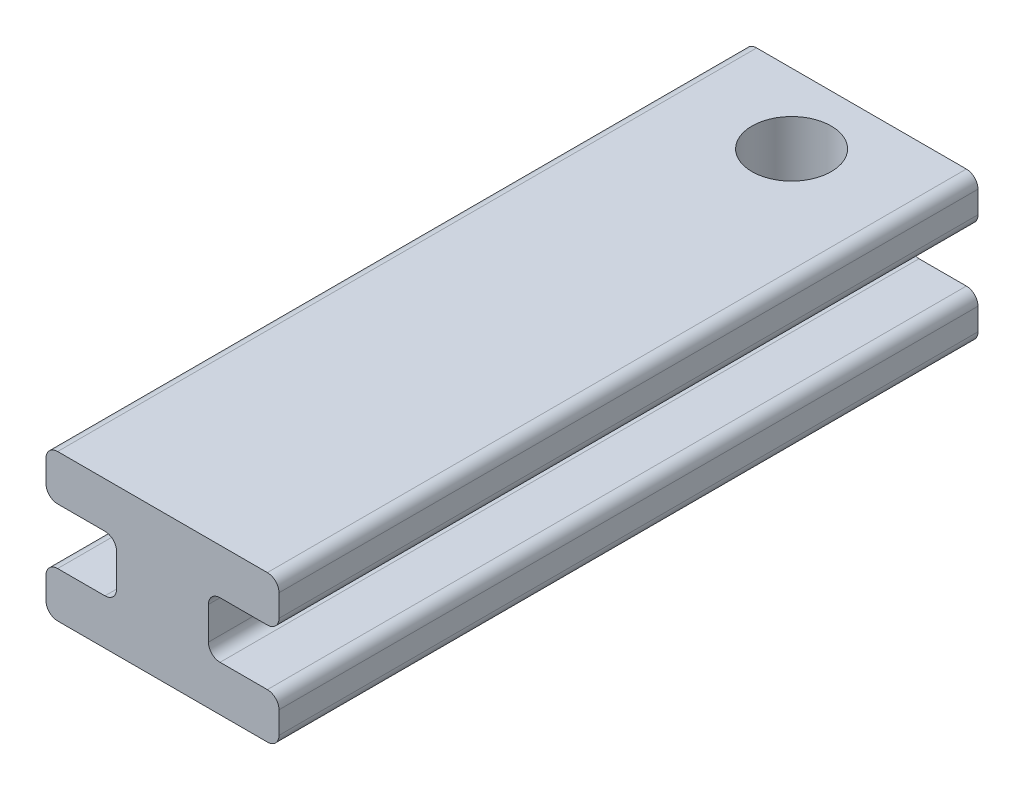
from build123d import *

# Parameters (mm, degrees)
EXTRUDE_1_DEPTH     = 30
FILLET_1_R          = 0.5
SKETCH_3_R          = 1.7
CUT_EXTRUDE_1_DEPTH = 32.059459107


with BuildPart() as part:
    # Sketch 2 → Extrude 1 (new body)
    with BuildSketch(Plane.XY):
        Polygon((-5, 3.15), (5, 3.15), (5, 1.2), (1.97, 1.2), (1.97, 0), (1.97, -1.2), (5, -1.2), (5, -3.15), (-5, -3.15), (-5, -1.2), (-1.97, -1.2), (-1.97, 1.2), (-5, 1.2), align=None)
    extrude(amount=EXTRUDE_1_DEPTH)

    # Fillet 1
    fillet_1_edges = [part.edges().sort_by_distance(p)[0] for p in [
        (5, 1.2, 15),
        (1.97, 1.2, 15),
        (1.97, -1.2, 15),
        (5, -1.2, 15),
        (5, -3.15, 15),
        (-5, -3.15, 15),
        (-5, -1.2, 15),
        (-1.97, -1.2, 15),
        (-1.97, 1.2, 15),
        (-5, 1.2, 15),
        (-5, 3.15, 15),
        (5, 3.15, 15),
    ]]
    fillet(fillet_1_edges, radius=FILLET_1_R)

    # Sketch 3 → Cut-Extrude 1 (cut, through all)
    with BuildSketch(Plane(origin=(0, 3.15, 0), x_dir=(1, 0, 0), z_dir=(0, 1, 0))):
        with Locations(Location((0, -3, 0), (0, 0, 180))):
            Circle(SKETCH_3_R)
    extrude(amount=-CUT_EXTRUDE_1_DEPTH, mode=Mode.SUBTRACT)


solid = part.part
